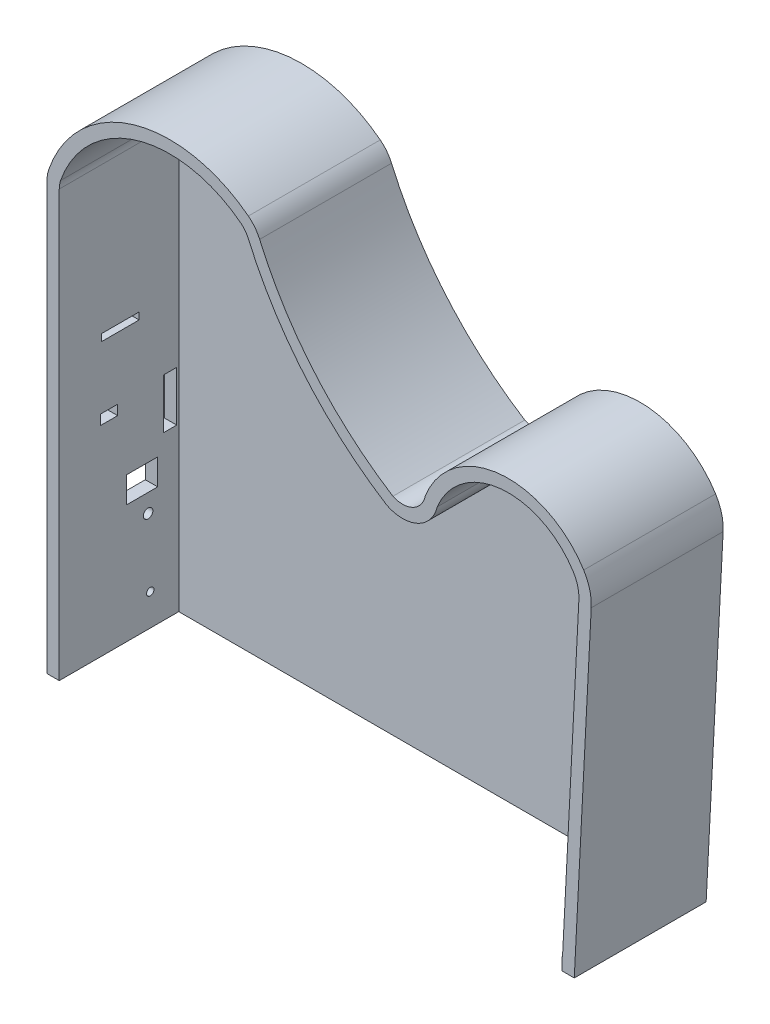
ISO-10303-21;
HEADER;
FILE_DESCRIPTION(('STEP AP214'),'2;1');
FILE_NAME('part.step','',(''),(''),'','','');
FILE_SCHEMA(('AUTOMOTIVE_DESIGN { 1 0 10303 214 1 1 1 1 }'));
ENDSEC;
DATA;
#1=APPLICATION_CONTEXT('core data for automotive mechanical design processes');
#2=APPLICATION_PROTOCOL_DEFINITION('international standard','automotive_design',2000,#1);
#3=PRODUCT_CONTEXT('',#1,'mechanical');
#4=PRODUCT('Part','Part','',(#3));
#5=PRODUCT_RELATED_PRODUCT_CATEGORY('part','',(#4));
#6=PRODUCT_DEFINITION_FORMATION('','',#4);
#7=PRODUCT_DEFINITION_CONTEXT('part definition',#1,'design');
#8=PRODUCT_DEFINITION('design','',#6,#7);
#9=PRODUCT_DEFINITION_SHAPE('','',#8);
#10=(LENGTH_UNIT() NAMED_UNIT(*) SI_UNIT(.MILLI.,.METRE.));
#11=(NAMED_UNIT(*) PLANE_ANGLE_UNIT() SI_UNIT($,.RADIAN.));
#12=(NAMED_UNIT(*) SI_UNIT($,.STERADIAN.) SOLID_ANGLE_UNIT());
#13=UNCERTAINTY_MEASURE_WITH_UNIT(LENGTH_MEASURE(1.E-05),#10,'distance_accuracy_value','');
#14=(GEOMETRIC_REPRESENTATION_CONTEXT(3) GLOBAL_UNCERTAINTY_ASSIGNED_CONTEXT((#13)) GLOBAL_UNIT_ASSIGNED_CONTEXT((#10,
#11,#12)) REPRESENTATION_CONTEXT('',''));
#15=CARTESIAN_POINT('',(0.,0.,0.));
#16=DIRECTION('',(0.,0.,1.));
#17=DIRECTION('',(1.,0.,0.));
#18=AXIS2_PLACEMENT_3D('',#15,#16,#17);
#19=CARTESIAN_POINT('',(0.,0.,-10.));
#20=DIRECTION('',(0.,0.,1.));
#21=DIRECTION('',(1.,0.,0.));
#22=AXIS2_PLACEMENT_3D('',#19,#20,#21);
#23=PLANE('',#22);
#24=CARTESIAN_POINT('',(468.596881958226,297.888088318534,-10.));
#25=DIRECTION('',(0.,0.,1.));
#26=DIRECTION('',(1.,0.,0.));
#27=AXIS2_PLACEMENT_3D('',#24,#25,#26);
#28=CIRCLE('',#27,71.9539704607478);
#29=CARTESIAN_POINT('',(401.59368414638,324.116800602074,-10.));
#30=VERTEX_POINT('',#29);
#31=CARTESIAN_POINT('',(529.512133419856,336.185686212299,-10.));
#32=VERTEX_POINT('',#31);
#33=EDGE_CURVE('E346',#30,#32,#28,.F.);
#34=ORIENTED_EDGE('',*,*,#33,.T.);
#35=CARTESIAN_POINT('',(495.648678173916,314.895632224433,-10.));
#36=DIRECTION('',(0.,0.,1.));
#37=DIRECTION('',(1.,0.,0.));
#38=AXIS2_PLACEMENT_3D('',#35,#36,#37);
#39=CIRCLE('',#38,40.);
#40=CARTESIAN_POINT('',(535.595522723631,312.834173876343,-10.));
#41=VERTEX_POINT('',#40);
#42=EDGE_CURVE('E11',#32,#41,#39,.F.);
#43=ORIENTED_EDGE('',*,*,#42,.T.);
#44=DIRECTION('',(-0.0515364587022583,-0.998671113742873,0.));
#45=VECTOR('',#44,1.);
#46=CARTESIAN_POINT('',(518.072036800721,-26.7351260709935,-10.));
#47=LINE('',#46,#45);
#48=CARTESIAN_POINT('',(521.881356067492,47.0816865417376,-10.));
#49=VERTEX_POINT('',#48);
#50=EDGE_CURVE('E320',#41,#49,#47,.T.);
#51=ORIENTED_EDGE('',*,*,#50,.T.);
#52=DIRECTION('',(-1.,0.,0.));
#53=VECTOR('',#52,1.);
#54=CARTESIAN_POINT('',(0.,47.0816865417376,-10.));
#55=LINE('',#54,#53);
#56=CARTESIAN_POINT('',(96.0120985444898,47.0816865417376,-10.));
#57=VERTEX_POINT('',#56);
#58=EDGE_CURVE('E307',#49,#57,#55,.T.);
#59=ORIENTED_EDGE('',*,*,#58,.T.);
#60=DIRECTION('',(0.,1.,0.));
#61=VECTOR('',#60,1.);
#62=CARTESIAN_POINT('',(96.0120985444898,0.,-10.));
#63=LINE('',#62,#61);
#64=CARTESIAN_POINT('',(96.0120985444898,390.867481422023,-10.));
#65=VERTEX_POINT('',#64);
#66=EDGE_CURVE('E306',#57,#65,#63,.T.);
#67=ORIENTED_EDGE('',*,*,#66,.T.);
#68=CARTESIAN_POINT('',(126.01209854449,390.867481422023,-10.));
#69=DIRECTION('',(0.,0.,1.));
#70=DIRECTION('',(1.,0.,0.));
#71=AXIS2_PLACEMENT_3D('',#68,#69,#70);
#72=CIRCLE('',#71,30.);
#73=CARTESIAN_POINT('',(97.6798278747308,400.730667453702,-10.));
#74=VERTEX_POINT('',#73);
#75=EDGE_CURVE('E341',#65,#74,#72,.F.);
#76=ORIENTED_EDGE('',*,*,#75,.T.);
#77=CARTESIAN_POINT('',(195.279411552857,366.753763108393,-10.));
#78=DIRECTION('',(0.,0.,1.));
#79=DIRECTION('',(1.,0.,0.));
#80=AXIS2_PLACEMENT_3D('',#77,#78,#79);
#81=CIRCLE('',#80,103.344611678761);
#82=CARTESIAN_POINT('',(258.713492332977,448.339461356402,-10.));
#83=VERTEX_POINT('',#82);
#84=EDGE_CURVE('E311',#74,#83,#81,.F.);
#85=ORIENTED_EDGE('',*,*,#84,.T.);
#86=CARTESIAN_POINT('',(240.299156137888,424.655875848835,-10.));
#87=DIRECTION('',(0.,0.,1.));
#88=DIRECTION('',(1.,0.,0.));
#89=AXIS2_PLACEMENT_3D('',#86,#87,#88);
#90=CIRCLE('',#89,30.);
#91=CARTESIAN_POINT('',(267.825723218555,436.584333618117,-10.));
#92=VERTEX_POINT('',#91);
#93=EDGE_CURVE('E324',#83,#92,#90,.F.);
#94=ORIENTED_EDGE('',*,*,#93,.T.);
#95=CARTESIAN_POINT('',(526.01209854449,548.467710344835,-10.));
#96=DIRECTION('',(0.,0.,1.));
#97=DIRECTION('',(1.,0.,0.));
#98=AXIS2_PLACEMENT_3D('',#95,#96,#97);
#99=CIRCLE('',#98,281.386023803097);
#100=CARTESIAN_POINT('',(375.446572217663,310.753350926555,-10.));
#101=VERTEX_POINT('',#100);
#102=EDGE_CURVE('E329',#101,#92,#99,.F.);
#103=ORIENTED_EDGE('',*,*,#102,.F.);
#104=CARTESIAN_POINT('',(383.206392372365,327.832005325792,-10.));
#105=DIRECTION('',(0.,0.,1.));
#106=DIRECTION('',(1.,0.,0.));
#107=AXIS2_PLACEMENT_3D('',#104,#105,#106);
#108=CIRCLE('',#107,18.7588710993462);
#109=EDGE_CURVE('E319',#101,#30,#108,.T.);
#110=ORIENTED_EDGE('',*,*,#109,.T.);
#111=EDGE_LOOP('',(#34,#43,#51,#59,#67,#76,#85,#94,#103,#110));
#112=FACE_BOUND('',#111,.T.);
#113=ADVANCED_FACE('F32',(#112),#23,.F.);
#114=CARTESIAN_POINT('',(195.279411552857,366.753763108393,0.));
#115=DIRECTION('',(0.,0.,1.));
#116=DIRECTION('',(1.,0.,0.));
#117=AXIS2_PLACEMENT_3D('',#114,#115,#116);
#118=CYLINDRICAL_SURFACE('',#117,103.344611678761);
#119=DIRECTION('',(0.,0.,1.));
#120=VECTOR('',#119,1.);
#121=CARTESIAN_POINT('',(97.6798278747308,400.730667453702,0.));
#122=LINE('',#121,#120);
#123=CARTESIAN_POINT('',(97.6798278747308,400.730667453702,96.5044158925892));
#124=VERTEX_POINT('',#123);
#125=EDGE_CURVE('E309',#74,#124,#122,.T.);
#126=ORIENTED_EDGE('',*,*,#125,.T.);
#127=CARTESIAN_POINT('',(195.279411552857,366.753763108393,96.5044158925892));
#128=DIRECTION('',(0.,0.,-1.));
#129=DIRECTION('',(-1.,0.,0.));
#130=AXIS2_PLACEMENT_3D('',#127,#128,#129);
#131=CIRCLE('',#130,103.344611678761);
#132=CARTESIAN_POINT('',(258.713492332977,448.339461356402,96.5044158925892));
#133=VERTEX_POINT('',#132);
#134=EDGE_CURVE('E366',#124,#133,#131,.T.);
#135=ORIENTED_EDGE('',*,*,#134,.T.);
#136=DIRECTION('',(0.,0.,1.));
#137=VECTOR('',#136,1.);
#138=CARTESIAN_POINT('',(258.713492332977,448.339461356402,0.));
#139=LINE('',#138,#137);
#140=EDGE_CURVE('E343',#133,#83,#139,.F.);
#141=ORIENTED_EDGE('',*,*,#140,.T.);
#142=ORIENTED_EDGE('',*,*,#84,.F.);
#143=EDGE_LOOP('',(#126,#135,#141,#142));
#144=FACE_BOUND('',#143,.T.);
#145=ADVANCED_FACE('F647',(#144),#118,.T.);
#146=CARTESIAN_POINT('',(96.0120985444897,525.036251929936,0.));
#147=DIRECTION('',(1.,0.,0.));
#148=DIRECTION('',(0.,1.,0.));
#149=AXIS2_PLACEMENT_3D('',#146,#147,#148);
#150=PLANE('',#149);
#151=CARTESIAN_POINT('',(96.0120985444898,72.6416865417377,23.));
#152=DIRECTION('',(-1.,0.,0.));
#153=DIRECTION('',(0.,-1.,0.));
#154=AXIS2_PLACEMENT_3D('',#151,#152,#153);
#155=CIRCLE('',#154,3.);
#156=CARTESIAN_POINT('',(96.0120985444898,69.6416865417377,23.));
#157=VERTEX_POINT('',#156);
#158=EDGE_CURVE('E374',#157,#157,#155,.T.);
#159=ORIENTED_EDGE('',*,*,#158,.F.);
#160=EDGE_LOOP('',(#159));
#161=FACE_BOUND('',#160,.T.);
#162=DIRECTION('',(0.,0.,-1.));
#163=VECTOR('',#162,1.);
#164=CARTESIAN_POINT('',(96.0120985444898,272.681686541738,62.42));
#165=LINE('',#164,#163);
#166=CARTESIAN_POINT('',(96.0120985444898,272.681686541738,62.42));
#167=VERTEX_POINT('',#166);
#168=CARTESIAN_POINT('',(96.0120985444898,272.681686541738,32.));
#169=VERTEX_POINT('',#168);
#170=EDGE_CURVE('E393',#167,#169,#165,.T.);
#171=ORIENTED_EDGE('',*,*,#170,.F.);
#172=DIRECTION('',(0.,1.,0.));
#173=VECTOR('',#172,1.);
#174=CARTESIAN_POINT('',(96.0120985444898,272.681686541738,62.42));
#175=LINE('',#174,#173);
#176=CARTESIAN_POINT('',(96.0120985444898,267.081686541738,62.42));
#177=VERTEX_POINT('',#176);
#178=EDGE_CURVE('E49',#177,#167,#175,.T.);
#179=ORIENTED_EDGE('',*,*,#178,.F.);
#180=DIRECTION('',(0.,0.,1.));
#181=VECTOR('',#180,1.);
#182=CARTESIAN_POINT('',(96.0120985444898,267.081686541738,62.42));
#183=LINE('',#182,#181);
#184=CARTESIAN_POINT('',(96.0120985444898,267.081686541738,32.));
#185=VERTEX_POINT('',#184);
#186=EDGE_CURVE('E384',#185,#177,#183,.T.);
#187=ORIENTED_EDGE('',*,*,#186,.F.);
#188=DIRECTION('',(0.,-1.,0.));
#189=VECTOR('',#188,1.);
#190=CARTESIAN_POINT('',(96.0120985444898,272.681686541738,32.));
#191=LINE('',#190,#189);
#192=EDGE_CURVE('E396',#169,#185,#191,.T.);
#193=ORIENTED_EDGE('',*,*,#192,.F.);
#194=EDGE_LOOP('',(#171,#179,#187,#193));
#195=FACE_BOUND('',#194,.T.);
#196=DIRECTION('',(0.,0.,-1.));
#197=VECTOR('',#196,1.);
#198=CARTESIAN_POINT('',(96.0120985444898,218.781686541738,12.45));
#199=LINE('',#198,#197);
#200=CARTESIAN_POINT('',(96.0120985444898,218.781686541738,12.45));
#201=VERTEX_POINT('',#200);
#202=CARTESIAN_POINT('',(96.0120985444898,218.781686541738,1.64999999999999));
#203=VERTEX_POINT('',#202);
#204=EDGE_CURVE('E424',#201,#203,#199,.T.);
#205=ORIENTED_EDGE('',*,*,#204,.F.);
#206=DIRECTION('',(0.,1.,0.));
#207=VECTOR('',#206,1.);
#208=CARTESIAN_POINT('',(96.0120985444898,218.781686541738,12.45));
#209=LINE('',#208,#207);
#210=CARTESIAN_POINT('',(96.0120985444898,178.381686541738,12.45));
#211=VERTEX_POINT('',#210);
#212=EDGE_CURVE('E403',#211,#201,#209,.T.);
#213=ORIENTED_EDGE('',*,*,#212,.F.);
#214=DIRECTION('',(0.,0.,1.));
#215=VECTOR('',#214,1.);
#216=CARTESIAN_POINT('',(96.0120985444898,178.381686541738,12.45));
#217=LINE('',#216,#215);
#218=CARTESIAN_POINT('',(96.0120985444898,178.381686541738,1.65));
#219=VERTEX_POINT('',#218);
#220=EDGE_CURVE('E413',#219,#211,#217,.T.);
#221=ORIENTED_EDGE('',*,*,#220,.F.);
#222=DIRECTION('',(0.,-1.,0.));
#223=VECTOR('',#222,1.);
#224=CARTESIAN_POINT('',(96.0120985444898,218.781686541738,1.64999999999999));
#225=LINE('',#224,#223);
#226=EDGE_CURVE('E427',#203,#219,#225,.T.);
#227=ORIENTED_EDGE('',*,*,#226,.F.);
#228=EDGE_LOOP('',(#205,#213,#221,#227));
#229=FACE_BOUND('',#228,.T.);
#230=DIRECTION('',(0.,0.,-1.));
#231=VECTOR('',#230,1.);
#232=CARTESIAN_POINT('',(96.0120985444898,216.831686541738,63.33));
#233=LINE('',#232,#231);
#234=CARTESIAN_POINT('',(96.0120985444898,216.831686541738,63.33));
#235=VERTEX_POINT('',#234);
#236=CARTESIAN_POINT('',(96.0120985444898,216.831686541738,49.33));
#237=VERTEX_POINT('',#236);
#238=EDGE_CURVE('E456',#235,#237,#233,.T.);
#239=ORIENTED_EDGE('',*,*,#238,.F.);
#240=DIRECTION('',(0.,1.,0.));
#241=VECTOR('',#240,1.);
#242=CARTESIAN_POINT('',(96.0120985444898,216.831686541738,63.33));
#243=LINE('',#242,#241);
#244=CARTESIAN_POINT('',(96.0120985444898,208.831686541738,63.33));
#245=VERTEX_POINT('',#244);
#246=EDGE_CURVE('E434',#245,#235,#243,.T.);
#247=ORIENTED_EDGE('',*,*,#246,.F.);
#248=DIRECTION('',(0.,0.,1.));
#249=VECTOR('',#248,1.);
#250=CARTESIAN_POINT('',(96.0120985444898,208.831686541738,63.33));
#251=LINE('',#250,#249);
#252=CARTESIAN_POINT('',(96.0120985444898,208.831686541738,49.33));
#253=VERTEX_POINT('',#252);
#254=EDGE_CURVE('E445',#253,#245,#251,.T.);
#255=ORIENTED_EDGE('',*,*,#254,.F.);
#256=DIRECTION('',(0.,-1.,0.));
#257=VECTOR('',#256,1.);
#258=CARTESIAN_POINT('',(96.0120985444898,216.831686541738,49.33));
#259=LINE('',#258,#257);
#260=EDGE_CURVE('E459',#237,#253,#259,.T.);
#261=ORIENTED_EDGE('',*,*,#260,.F.);
#262=EDGE_LOOP('',(#239,#247,#255,#261));
#263=FACE_BOUND('',#262,.T.);
#264=DIRECTION('',(0.,0.,-1.));
#265=VECTOR('',#264,1.);
#266=CARTESIAN_POINT('',(96.0120985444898,163.851686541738,42.));
#267=LINE('',#266,#265);
#268=CARTESIAN_POINT('',(96.0120985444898,163.851686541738,42.));
#269=VERTEX_POINT('',#268);
#270=CARTESIAN_POINT('',(96.0120985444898,163.851686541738,17.));
#271=VERTEX_POINT('',#270);
#272=EDGE_CURVE('E488',#269,#271,#267,.T.);
#273=ORIENTED_EDGE('',*,*,#272,.F.);
#274=DIRECTION('',(0.,1.,0.));
#275=VECTOR('',#274,1.);
#276=CARTESIAN_POINT('',(96.0120985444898,163.851686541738,42.));
#277=LINE('',#276,#275);
#278=CARTESIAN_POINT('',(96.0120985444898,142.851686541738,42.));
#279=VERTEX_POINT('',#278);
#280=EDGE_CURVE('E466',#279,#269,#277,.T.);
#281=ORIENTED_EDGE('',*,*,#280,.F.);
#282=DIRECTION('',(0.,0.,1.));
#283=VECTOR('',#282,1.);
#284=CARTESIAN_POINT('',(96.0120985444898,142.851686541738,42.));
#285=LINE('',#284,#283);
#286=CARTESIAN_POINT('',(96.0120985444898,142.851686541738,17.));
#287=VERTEX_POINT('',#286);
#288=EDGE_CURVE('E477',#287,#279,#285,.T.);
#289=ORIENTED_EDGE('',*,*,#288,.F.);
#290=DIRECTION('',(0.,-1.,0.));
#291=VECTOR('',#290,1.);
#292=CARTESIAN_POINT('',(96.0120985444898,163.851686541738,17.));
#293=LINE('',#292,#291);
#294=EDGE_CURVE('E491',#271,#287,#293,.T.);
#295=ORIENTED_EDGE('',*,*,#294,.F.);
#296=EDGE_LOOP('',(#273,#281,#289,#295));
#297=FACE_BOUND('',#296,.T.);
#298=CARTESIAN_POINT('',(96.0120985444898,128.171686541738,24.75));
#299=DIRECTION('',(-1.,0.,0.));
#300=DIRECTION('',(0.,-1.,0.));
#301=AXIS2_PLACEMENT_3D('',#298,#299,#300);
#302=CIRCLE('',#301,3.84999999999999);
#303=CARTESIAN_POINT('',(96.0120985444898,124.321686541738,24.75));
#304=VERTEX_POINT('',#303);
#305=EDGE_CURVE('E498',#304,#304,#302,.T.);
#306=ORIENTED_EDGE('',*,*,#305,.F.);
#307=EDGE_LOOP('',(#306));
#308=FACE_BOUND('',#307,.T.);
#309=DIRECTION('',(0.,0.,1.));
#310=VECTOR('',#309,1.);
#311=CARTESIAN_POINT('',(96.0120985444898,47.0816865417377,0.));
#312=LINE('',#311,#310);
#313=CARTESIAN_POINT('',(96.0120985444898,47.0816865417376,96.5044158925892));
#314=VERTEX_POINT('',#313);
#315=EDGE_CURVE('E296',#57,#314,#312,.T.);
#316=ORIENTED_EDGE('',*,*,#315,.T.);
#317=DIRECTION('',(0.,-1.,0.));
#318=VECTOR('',#317,1.);
#319=CARTESIAN_POINT('',(96.0120985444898,183.981686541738,96.5044158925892));
#320=LINE('',#319,#318);
#321=CARTESIAN_POINT('',(96.0120985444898,390.867481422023,96.5044158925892));
#322=VERTEX_POINT('',#321);
#323=EDGE_CURVE('E278',#322,#314,#320,.T.);
#324=ORIENTED_EDGE('',*,*,#323,.F.);
#325=DIRECTION('',(0.,0.,1.));
#326=VECTOR('',#325,1.);
#327=CARTESIAN_POINT('',(96.0120985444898,390.867481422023,0.));
#328=LINE('',#327,#326);
#329=EDGE_CURVE('E315',#322,#65,#328,.F.);
#330=ORIENTED_EDGE('',*,*,#329,.T.);
#331=ORIENTED_EDGE('',*,*,#66,.F.);
#332=EDGE_LOOP('',(#316,#324,#330,#331));
#333=FACE_BOUND('',#332,.T.);
#334=ADVANCED_FACE('F304',(#161,#195,#229,#263,#297,#308,#333),#150,.F.);
#335=CARTESIAN_POINT('',(69.0590141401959,47.0816865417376,0.));
#336=DIRECTION('',(0.,1.,0.));
#337=DIRECTION('',(0.,0.,1.));
#338=AXIS2_PLACEMENT_3D('',#335,#336,#337);
#339=PLANE('',#338);
#340=DIRECTION('',(0.,0.,1.));
#341=VECTOR('',#340,1.);
#342=CARTESIAN_POINT('',(521.881356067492,47.0816865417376,0.));
#343=LINE('',#342,#341);
#344=CARTESIAN_POINT('',(521.881356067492,47.0816865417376,96.5044158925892));
#345=VERTEX_POINT('',#344);
#346=EDGE_CURVE('E317',#49,#345,#343,.T.);
#347=ORIENTED_EDGE('',*,*,#346,.T.);
#348=DIRECTION('',(-1.,0.,0.));
#349=VECTOR('',#348,1.);
#350=CARTESIAN_POINT('',(69.0590141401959,47.0816865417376,96.5044158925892));
#351=LINE('',#350,#349);
#352=CARTESIAN_POINT('',(511.881356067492,47.0816865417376,96.5044158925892));
#353=VERTEX_POINT('',#352);
#354=EDGE_CURVE('E303',#345,#353,#351,.T.);
#355=ORIENTED_EDGE('',*,*,#354,.T.);
#356=DIRECTION('',(0.,0.,1.));
#357=VECTOR('',#356,1.);
#358=CARTESIAN_POINT('',(511.881356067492,47.0816865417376,262.314415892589));
#359=LINE('',#358,#357);
#360=CARTESIAN_POINT('',(511.881356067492,47.0816865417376,0.));
#361=VERTEX_POINT('',#360);
#362=EDGE_CURVE('E518',#361,#353,#359,.T.);
#363=ORIENTED_EDGE('',*,*,#362,.F.);
#364=DIRECTION('',(1.,0.,0.));
#365=VECTOR('',#364,1.);
#366=CARTESIAN_POINT('',(106.01209854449,47.0816865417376,0.));
#367=LINE('',#366,#365);
#368=CARTESIAN_POINT('',(106.01209854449,47.0816865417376,0.));
#369=VERTEX_POINT('',#368);
#370=EDGE_CURVE('E520',#369,#361,#367,.T.);
#371=ORIENTED_EDGE('',*,*,#370,.F.);
#372=DIRECTION('',(0.,0.,-1.));
#373=VECTOR('',#372,1.);
#374=CARTESIAN_POINT('',(106.01209854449,47.0816865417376,262.314415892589));
#375=LINE('',#374,#373);
#376=CARTESIAN_POINT('',(106.01209854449,47.0816865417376,96.5044158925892));
#377=VERTEX_POINT('',#376);
#378=EDGE_CURVE('E299',#377,#369,#375,.T.);
#379=ORIENTED_EDGE('',*,*,#378,.F.);
#380=EDGE_CURVE('E281',#377,#314,#351,.T.);
#381=ORIENTED_EDGE('',*,*,#380,.T.);
#382=ORIENTED_EDGE('',*,*,#315,.F.);
#383=ORIENTED_EDGE('',*,*,#58,.F.);
#384=EDGE_LOOP('',(#347,#355,#363,#371,#379,#381,#382,#383));
#385=FACE_BOUND('',#384,.T.);
#386=ADVANCED_FACE('F294',(#385),#339,.F.);
#387=CARTESIAN_POINT('',(126.01209854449,390.867481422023,0.));
#388=DIRECTION('',(0.,0.,1.));
#389=DIRECTION('',(1.,0.,0.));
#390=AXIS2_PLACEMENT_3D('',#387,#388,#389);
#391=CYLINDRICAL_SURFACE('',#390,30.);
#392=CARTESIAN_POINT('',(126.01209854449,390.867481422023,96.5044158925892));
#393=DIRECTION('',(0.,0.,-1.));
#394=DIRECTION('',(-1.,0.,0.));
#395=AXIS2_PLACEMENT_3D('',#392,#393,#394);
#396=CIRCLE('',#395,30.);
#397=EDGE_CURVE('E284',#124,#322,#396,.F.);
#398=ORIENTED_EDGE('',*,*,#397,.F.);
#399=ORIENTED_EDGE('',*,*,#125,.F.);
#400=ORIENTED_EDGE('',*,*,#75,.F.);
#401=ORIENTED_EDGE('',*,*,#329,.F.);
#402=EDGE_LOOP('',(#398,#399,#400,#401));
#403=FACE_BOUND('',#402,.T.);
#404=ADVANCED_FACE('F663',(#403),#391,.T.);
#405=CARTESIAN_POINT('',(383.206392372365,327.832005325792,0.));
#406=DIRECTION('',(0.,0.,1.));
#407=DIRECTION('',(1.,0.,0.));
#408=AXIS2_PLACEMENT_3D('',#405,#406,#407);
#409=CYLINDRICAL_SURFACE('',#408,18.7588710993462);
#410=DIRECTION('',(0.,0.,1.));
#411=VECTOR('',#410,1.);
#412=CARTESIAN_POINT('',(375.446572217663,310.753350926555,-10.));
#413=LINE('',#412,#411);
#414=CARTESIAN_POINT('',(375.446572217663,310.753350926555,96.5044158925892));
#415=VERTEX_POINT('',#414);
#416=EDGE_CURVE('E328',#101,#415,#413,.T.);
#417=ORIENTED_EDGE('',*,*,#416,.T.);
#418=CARTESIAN_POINT('',(383.206392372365,327.832005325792,96.5044158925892));
#419=DIRECTION('',(0.,0.,-1.));
#420=DIRECTION('',(-1.,0.,0.));
#421=AXIS2_PLACEMENT_3D('',#418,#419,#420);
#422=CIRCLE('',#421,18.7588710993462);
#423=CARTESIAN_POINT('',(401.59368414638,324.116800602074,96.5044158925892));
#424=VERTEX_POINT('',#423);
#425=EDGE_CURVE('E369',#415,#424,#422,.F.);
#426=ORIENTED_EDGE('',*,*,#425,.T.);
#427=DIRECTION('',(0.,0.,1.));
#428=VECTOR('',#427,1.);
#429=CARTESIAN_POINT('',(401.59368414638,324.116800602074,-10.));
#430=LINE('',#429,#428);
#431=EDGE_CURVE('E326',#30,#424,#430,.T.);
#432=ORIENTED_EDGE('',*,*,#431,.F.);
#433=ORIENTED_EDGE('',*,*,#109,.F.);
#434=EDGE_LOOP('',(#417,#426,#432,#433));
#435=FACE_BOUND('',#434,.T.);
#436=ADVANCED_FACE('F630',(#435),#409,.F.);
#437=CARTESIAN_POINT('',(526.01209854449,548.467710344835,0.));
#438=DIRECTION('',(0.,0.,1.));
#439=DIRECTION('',(1.,0.,0.));
#440=AXIS2_PLACEMENT_3D('',#437,#438,#439);
#441=CYLINDRICAL_SURFACE('',#440,281.386023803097);
#442=CARTESIAN_POINT('',(526.01209854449,548.467710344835,96.5044158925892));
#443=DIRECTION('',(0.,0.,-1.));
#444=DIRECTION('',(-1.,0.,0.));
#445=AXIS2_PLACEMENT_3D('',#442,#443,#444);
#446=CIRCLE('',#445,281.386023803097);
#447=CARTESIAN_POINT('',(267.825723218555,436.584333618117,96.5044158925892));
#448=VERTEX_POINT('',#447);
#449=EDGE_CURVE('E359',#415,#448,#446,.T.);
#450=ORIENTED_EDGE('',*,*,#449,.F.);
#451=ORIENTED_EDGE('',*,*,#416,.F.);
#452=ORIENTED_EDGE('',*,*,#102,.T.);
#453=DIRECTION('',(0.,0.,1.));
#454=VECTOR('',#453,1.);
#455=CARTESIAN_POINT('',(267.825723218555,436.584333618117,0.));
#456=LINE('',#455,#454);
#457=EDGE_CURVE('E36',#92,#448,#456,.T.);
#458=ORIENTED_EDGE('',*,*,#457,.T.);
#459=EDGE_LOOP('',(#450,#451,#452,#458));
#460=FACE_BOUND('',#459,.T.);
#461=ADVANCED_FACE('F358',(#460),#441,.F.);
#462=CARTESIAN_POINT('',(468.596881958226,297.888088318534,0.));
#463=DIRECTION('',(0.,0.,1.));
#464=DIRECTION('',(1.,0.,0.));
#465=AXIS2_PLACEMENT_3D('',#462,#463,#464);
#466=CYLINDRICAL_SURFACE('',#465,71.9539704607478);
#467=ORIENTED_EDGE('',*,*,#431,.T.);
#468=CARTESIAN_POINT('',(468.596881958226,297.888088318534,96.5044158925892));
#469=DIRECTION('',(0.,0.,-1.));
#470=DIRECTION('',(-1.,0.,0.));
#471=AXIS2_PLACEMENT_3D('',#468,#469,#470);
#472=CIRCLE('',#471,71.9539704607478);
#473=CARTESIAN_POINT('',(529.512133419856,336.185686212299,96.5044158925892));
#474=VERTEX_POINT('',#473);
#475=EDGE_CURVE('E628',#424,#474,#472,.T.);
#476=ORIENTED_EDGE('',*,*,#475,.T.);
#477=DIRECTION('',(0.,0.,1.));
#478=VECTOR('',#477,1.);
#479=CARTESIAN_POINT('',(529.512133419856,336.185686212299,0.));
#480=LINE('',#479,#478);
#481=EDGE_CURVE('E41',#474,#32,#480,.F.);
#482=ORIENTED_EDGE('',*,*,#481,.T.);
#483=ORIENTED_EDGE('',*,*,#33,.F.);
#484=EDGE_LOOP('',(#467,#476,#482,#483));
#485=FACE_BOUND('',#484,.T.);
#486=ADVANCED_FACE('F633',(#485),#466,.T.);
#487=CARTESIAN_POINT('',(240.299156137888,424.655875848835,0.));
#488=DIRECTION('',(0.,0.,-1.));
#489=DIRECTION('',(-1.,0.,0.));
#490=AXIS2_PLACEMENT_3D('',#487,#488,#489);
#491=CYLINDRICAL_SURFACE('',#490,30.);
#492=CARTESIAN_POINT('',(240.299156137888,424.655875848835,96.5044158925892));
#493=DIRECTION('',(0.,0.,-1.));
#494=DIRECTION('',(-1.,0.,0.));
#495=AXIS2_PLACEMENT_3D('',#492,#493,#494);
#496=CIRCLE('',#495,30.);
#497=EDGE_CURVE('E365',#448,#133,#496,.F.);
#498=ORIENTED_EDGE('',*,*,#497,.F.);
#499=ORIENTED_EDGE('',*,*,#457,.F.);
#500=ORIENTED_EDGE('',*,*,#93,.F.);
#501=ORIENTED_EDGE('',*,*,#140,.F.);
#502=EDGE_LOOP('',(#498,#499,#500,#501));
#503=FACE_BOUND('',#502,.T.);
#504=ADVANCED_FACE('F363',(#503),#491,.T.);
#505=CARTESIAN_POINT('',(535.998809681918,320.649049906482,0.));
#506=DIRECTION('',(-0.998671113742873,0.0515364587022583,0.));
#507=DIRECTION('',(-0.0515364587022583,-0.998671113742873,0.));
#508=AXIS2_PLACEMENT_3D('',#505,#506,#507);
#509=PLANE('',#508);
#510=DIRECTION('',(0.0515364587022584,0.998671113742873,0.));
#511=VECTOR('',#510,1.);
#512=CARTESIAN_POINT('',(522.413629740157,57.3960611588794,96.5044158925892));
#513=LINE('',#512,#511);
#514=CARTESIAN_POINT('',(535.595522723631,312.834173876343,96.5044158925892));
#515=VERTEX_POINT('',#514);
#516=EDGE_CURVE('E509',#345,#515,#513,.T.);
#517=ORIENTED_EDGE('',*,*,#516,.F.);
#518=ORIENTED_EDGE('',*,*,#346,.F.);
#519=ORIENTED_EDGE('',*,*,#50,.F.);
#520=DIRECTION('',(0.,0.,1.));
#521=VECTOR('',#520,1.);
#522=CARTESIAN_POINT('',(535.595522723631,312.834173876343,0.));
#523=LINE('',#522,#521);
#524=EDGE_CURVE('E321',#41,#515,#523,.T.);
#525=ORIENTED_EDGE('',*,*,#524,.T.);
#526=EDGE_LOOP('',(#517,#518,#519,#525));
#527=FACE_BOUND('',#526,.T.);
#528=ADVANCED_FACE('F583',(#527),#509,.F.);
#529=CARTESIAN_POINT('',(495.648678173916,314.895632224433,0.));
#530=DIRECTION('',(0.,0.,1.));
#531=DIRECTION('',(1.,0.,0.));
#532=AXIS2_PLACEMENT_3D('',#529,#530,#531);
#533=CYLINDRICAL_SURFACE('',#532,40.);
#534=CARTESIAN_POINT('',(495.648678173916,314.895632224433,96.5044158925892));
#535=DIRECTION('',(0.,0.,-1.));
#536=DIRECTION('',(-1.,0.,0.));
#537=AXIS2_PLACEMENT_3D('',#534,#535,#536);
#538=CIRCLE('',#537,40.);
#539=EDGE_CURVE('E626',#515,#474,#538,.F.);
#540=ORIENTED_EDGE('',*,*,#539,.F.);
#541=ORIENTED_EDGE('',*,*,#524,.F.);
#542=ORIENTED_EDGE('',*,*,#42,.F.);
#543=ORIENTED_EDGE('',*,*,#481,.F.);
#544=EDGE_LOOP('',(#540,#541,#542,#543));
#545=FACE_BOUND('',#544,.T.);
#546=ADVANCED_FACE('F34',(#545),#533,.T.);
#547=CARTESIAN_POINT('',(0.,0.,0.));
#548=DIRECTION('',(0.,0.,1.));
#549=DIRECTION('',(1.,0.,0.));
#550=AXIS2_PLACEMENT_3D('',#547,#548,#549);
#551=PLANE('',#550);
#552=CARTESIAN_POINT('',(468.596881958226,297.888088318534,0.));
#553=DIRECTION('',(0.,0.,1.));
#554=DIRECTION('',(1.,0.,0.));
#555=AXIS2_PLACEMENT_3D('',#552,#553,#554);
#556=CIRCLE('',#555,61.9539704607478);
#557=CARTESIAN_POINT('',(411.181665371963,321.164414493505,0.));
#558=VERTEX_POINT('',#557);
#559=CARTESIAN_POINT('',(521.046269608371,330.863172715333,0.));
#560=VERTEX_POINT('',#559);
#561=EDGE_CURVE('E534',#558,#560,#556,.F.);
#562=ORIENTED_EDGE('',*,*,#561,.F.);
#563=CARTESIAN_POINT('',(383.206392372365,327.832005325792,0.));
#564=DIRECTION('',(0.,0.,1.));
#565=DIRECTION('',(1.,0.,0.));
#566=AXIS2_PLACEMENT_3D('',#563,#564,#565);
#567=CIRCLE('',#566,28.7588710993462);
#568=CARTESIAN_POINT('',(370.623095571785,301.972126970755,0.));
#569=VERTEX_POINT('',#568);
#570=EDGE_CURVE('E531',#569,#558,#567,.T.);
#571=ORIENTED_EDGE('',*,*,#570,.F.);
#572=CARTESIAN_POINT('',(526.01209854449,548.467710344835,0.));
#573=DIRECTION('',(0.,0.,1.));
#574=DIRECTION('',(1.,0.,0.));
#575=AXIS2_PLACEMENT_3D('',#572,#573,#574);
#576=CIRCLE('',#575,291.386023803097);
#577=CARTESIAN_POINT('',(258.650200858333,432.608181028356,0.));
#578=VERTEX_POINT('',#577);
#579=EDGE_CURVE('E537',#569,#578,#576,.F.);
#580=ORIENTED_EDGE('',*,*,#579,.T.);
#581=CARTESIAN_POINT('',(240.299156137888,424.655875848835,0.));
#582=DIRECTION('',(0.,0.,1.));
#583=DIRECTION('',(1.,0.,0.));
#584=AXIS2_PLACEMENT_3D('',#581,#582,#583);
#585=CIRCLE('',#584,20.);
#586=CARTESIAN_POINT('',(252.575380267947,440.44493285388,0.));
#587=VERTEX_POINT('',#586);
#588=EDGE_CURVE('E567',#587,#578,#585,.F.);
#589=ORIENTED_EDGE('',*,*,#588,.F.);
#590=CARTESIAN_POINT('',(195.279411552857,366.753763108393,0.));
#591=DIRECTION('',(0.,0.,1.));
#592=DIRECTION('',(1.,0.,0.));
#593=AXIS2_PLACEMENT_3D('',#590,#591,#592);
#594=CIRCLE('',#593,93.3446116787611);
#595=CARTESIAN_POINT('',(107.123918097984,397.442938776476,0.));
#596=VERTEX_POINT('',#595);
#597=EDGE_CURVE('E544',#596,#587,#594,.F.);
#598=ORIENTED_EDGE('',*,*,#597,.F.);
#599=CARTESIAN_POINT('',(126.01209854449,390.867481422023,0.));
#600=DIRECTION('',(0.,0.,1.));
#601=DIRECTION('',(1.,0.,0.));
#602=AXIS2_PLACEMENT_3D('',#599,#600,#601);
#603=CIRCLE('',#602,20.);
#604=CARTESIAN_POINT('',(106.01209854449,390.867481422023,0.));
#605=VERTEX_POINT('',#604);
#606=EDGE_CURVE('E560',#605,#596,#603,.F.);
#607=ORIENTED_EDGE('',*,*,#606,.F.);
#608=DIRECTION('',(0.,1.,0.));
#609=VECTOR('',#608,1.);
#610=CARTESIAN_POINT('',(106.01209854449,0.,0.));
#611=LINE('',#610,#609);
#612=EDGE_CURVE('E552',#369,#605,#611,.T.);
#613=ORIENTED_EDGE('',*,*,#612,.F.);
#614=ORIENTED_EDGE('',*,*,#370,.T.);
#615=DIRECTION('',(0.,-1.,0.));
#616=VECTOR('',#615,1.);
#617=CARTESIAN_POINT('',(511.881356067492,57.0816865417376,0.));
#618=LINE('',#617,#616);
#619=CARTESIAN_POINT('',(511.881356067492,57.0816865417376,0.));
#620=VERTEX_POINT('',#619);
#621=EDGE_CURVE('E517',#620,#361,#618,.T.);
#622=ORIENTED_EDGE('',*,*,#621,.F.);
#623=DIRECTION('',(-1.,0.,0.));
#624=VECTOR('',#623,1.);
#625=CARTESIAN_POINT('',(69.0590141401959,57.0816865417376,0.));
#626=LINE('',#625,#624);
#627=CARTESIAN_POINT('',(512.384099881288,57.0816865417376,0.));
#628=VERTEX_POINT('',#627);
#629=EDGE_CURVE('E549',#628,#620,#626,.T.);
#630=ORIENTED_EDGE('',*,*,#629,.F.);
#631=DIRECTION('',(-0.0515364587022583,-0.998671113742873,0.));
#632=VECTOR('',#631,1.);
#633=CARTESIAN_POINT('',(526.01209854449,321.164414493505,0.));
#634=LINE('',#633,#632);
#635=CARTESIAN_POINT('',(525.608811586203,313.349538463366,0.));
#636=VERTEX_POINT('',#635);
#637=EDGE_CURVE('E526',#636,#628,#634,.T.);
#638=ORIENTED_EDGE('',*,*,#637,.F.);
#639=CARTESIAN_POINT('',(495.648678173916,314.895632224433,0.));
#640=DIRECTION('',(0.,0.,1.));
#641=DIRECTION('',(1.,0.,0.));
#642=AXIS2_PLACEMENT_3D('',#639,#640,#641);
#643=CIRCLE('',#642,30.);
#644=EDGE_CURVE('E574',#560,#636,#643,.F.);
#645=ORIENTED_EDGE('',*,*,#644,.F.);
#646=EDGE_LOOP('',(#562,#571,#580,#589,#598,#607,#613,#614,#622,#630,#638,#645));
#647=FACE_BOUND('',#646,.T.);
#648=ADVANCED_FACE('F596',(#647),#551,.T.);
#649=CARTESIAN_POINT('',(195.279411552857,366.753763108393,0.));
#650=DIRECTION('',(0.,0.,1.));
#651=DIRECTION('',(1.,0.,0.));
#652=AXIS2_PLACEMENT_3D('',#649,#650,#651);
#653=CYLINDRICAL_SURFACE('',#652,93.3446116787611);
#654=CARTESIAN_POINT('',(195.279411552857,366.753763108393,96.5044158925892));
#655=DIRECTION('',(0.,0.,-1.));
#656=DIRECTION('',(-1.,0.,0.));
#657=AXIS2_PLACEMENT_3D('',#654,#655,#656);
#658=CIRCLE('',#657,93.3446116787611);
#659=CARTESIAN_POINT('',(107.123918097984,397.442938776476,96.5044158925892));
#660=VERTEX_POINT('',#659);
#661=CARTESIAN_POINT('',(252.575380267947,440.44493285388,96.5044158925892));
#662=VERTEX_POINT('',#661);
#663=EDGE_CURVE('E608',#660,#662,#658,.T.);
#664=ORIENTED_EDGE('',*,*,#663,.F.);
#665=DIRECTION('',(0.,0.,1.));
#666=VECTOR('',#665,1.);
#667=CARTESIAN_POINT('',(107.123918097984,397.442938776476,0.));
#668=LINE('',#667,#666);
#669=EDGE_CURVE('E555',#596,#660,#668,.T.);
#670=ORIENTED_EDGE('',*,*,#669,.F.);
#671=ORIENTED_EDGE('',*,*,#597,.T.);
#672=DIRECTION('',(0.,0.,1.));
#673=VECTOR('',#672,1.);
#674=CARTESIAN_POINT('',(252.575380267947,440.44493285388,0.));
#675=LINE('',#674,#673);
#676=EDGE_CURVE('E565',#662,#587,#675,.F.);
#677=ORIENTED_EDGE('',*,*,#676,.F.);
#678=EDGE_LOOP('',(#664,#670,#671,#677));
#679=FACE_BOUND('',#678,.T.);
#680=ADVANCED_FACE('F643',(#679),#653,.F.);
#681=CARTESIAN_POINT('',(106.01209854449,525.036251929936,0.));
#682=DIRECTION('',(1.,0.,0.));
#683=DIRECTION('',(0.,1.,0.));
#684=AXIS2_PLACEMENT_3D('',#681,#682,#683);
#685=PLANE('',#684);
#686=DIRECTION('',(0.,-1.,0.));
#687=VECTOR('',#686,1.);
#688=CARTESIAN_POINT('',(106.01209854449,183.981686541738,96.5044158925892));
#689=LINE('',#688,#687);
#690=CARTESIAN_POINT('',(106.01209854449,390.867481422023,96.5044158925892));
#691=VERTEX_POINT('',#690);
#692=EDGE_CURVE('E288',#691,#377,#689,.T.);
#693=ORIENTED_EDGE('',*,*,#692,.T.);
#694=ORIENTED_EDGE('',*,*,#378,.T.);
#695=ORIENTED_EDGE('',*,*,#612,.T.);
#696=DIRECTION('',(0.,0.,1.));
#697=VECTOR('',#696,1.);
#698=CARTESIAN_POINT('',(106.01209854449,390.867481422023,0.));
#699=LINE('',#698,#697);
#700=EDGE_CURVE('E558',#691,#605,#699,.F.);
#701=ORIENTED_EDGE('',*,*,#700,.F.);
#702=EDGE_LOOP('',(#693,#694,#695,#701));
#703=FACE_BOUND('',#702,.T.);
#704=CARTESIAN_POINT('',(106.01209854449,72.6416865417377,23.));
#705=DIRECTION('',(-1.,0.,0.));
#706=DIRECTION('',(0.,-1.,0.));
#707=AXIS2_PLACEMENT_3D('',#704,#705,#706);
#708=CIRCLE('',#707,3.);
#709=CARTESIAN_POINT('',(106.01209854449,69.6416865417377,23.));
#710=VERTEX_POINT('',#709);
#711=EDGE_CURVE('E375',#710,#710,#708,.T.);
#712=ORIENTED_EDGE('',*,*,#711,.T.);
#713=EDGE_LOOP('',(#712));
#714=FACE_BOUND('',#713,.T.);
#715=DIRECTION('',(0.,1.,0.));
#716=VECTOR('',#715,1.);
#717=CARTESIAN_POINT('',(106.01209854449,272.681686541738,62.42));
#718=LINE('',#717,#716);
#719=CARTESIAN_POINT('',(106.01209854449,267.081686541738,62.42));
#720=VERTEX_POINT('',#719);
#721=CARTESIAN_POINT('',(106.01209854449,272.681686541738,62.42));
#722=VERTEX_POINT('',#721);
#723=EDGE_CURVE('E380',#720,#722,#718,.T.);
#724=ORIENTED_EDGE('',*,*,#723,.T.);
#725=DIRECTION('',(0.,0.,-1.));
#726=VECTOR('',#725,1.);
#727=CARTESIAN_POINT('',(106.01209854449,272.681686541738,62.42));
#728=LINE('',#727,#726);
#729=CARTESIAN_POINT('',(106.01209854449,272.681686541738,32.));
#730=VERTEX_POINT('',#729);
#731=EDGE_CURVE('E383',#722,#730,#728,.T.);
#732=ORIENTED_EDGE('',*,*,#731,.T.);
#733=DIRECTION('',(0.,-1.,0.));
#734=VECTOR('',#733,1.);
#735=CARTESIAN_POINT('',(106.01209854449,272.681686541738,32.));
#736=LINE('',#735,#734);
#737=CARTESIAN_POINT('',(106.01209854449,267.081686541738,32.));
#738=VERTEX_POINT('',#737);
#739=EDGE_CURVE('E57',#730,#738,#736,.T.);
#740=ORIENTED_EDGE('',*,*,#739,.T.);
#741=DIRECTION('',(0.,0.,1.));
#742=VECTOR('',#741,1.);
#743=CARTESIAN_POINT('',(106.01209854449,267.081686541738,62.42));
#744=LINE('',#743,#742);
#745=EDGE_CURVE('E388',#738,#720,#744,.T.);
#746=ORIENTED_EDGE('',*,*,#745,.T.);
#747=EDGE_LOOP('',(#724,#732,#740,#746));
#748=FACE_BOUND('',#747,.T.);
#749=DIRECTION('',(0.,1.,0.));
#750=VECTOR('',#749,1.);
#751=CARTESIAN_POINT('',(106.01209854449,218.781686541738,12.45));
#752=LINE('',#751,#750);
#753=CARTESIAN_POINT('',(106.01209854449,178.381686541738,12.45));
#754=VERTEX_POINT('',#753);
#755=CARTESIAN_POINT('',(106.01209854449,218.781686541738,12.45));
#756=VERTEX_POINT('',#755);
#757=EDGE_CURVE('E409',#754,#756,#752,.T.);
#758=ORIENTED_EDGE('',*,*,#757,.T.);
#759=DIRECTION('',(0.,0.,-1.));
#760=VECTOR('',#759,1.);
#761=CARTESIAN_POINT('',(106.01209854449,218.781686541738,12.45));
#762=LINE('',#761,#760);
#763=CARTESIAN_POINT('',(106.01209854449,218.781686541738,1.64999999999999));
#764=VERTEX_POINT('',#763);
#765=EDGE_CURVE('E412',#756,#764,#762,.T.);
#766=ORIENTED_EDGE('',*,*,#765,.T.);
#767=DIRECTION('',(0.,-1.,0.));
#768=VECTOR('',#767,1.);
#769=CARTESIAN_POINT('',(106.01209854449,218.781686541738,1.64999999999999));
#770=LINE('',#769,#768);
#771=CARTESIAN_POINT('',(106.01209854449,178.381686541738,1.65));
#772=VERTEX_POINT('',#771);
#773=EDGE_CURVE('E416',#764,#772,#770,.T.);
#774=ORIENTED_EDGE('',*,*,#773,.T.);
#775=DIRECTION('',(0.,0.,1.));
#776=VECTOR('',#775,1.);
#777=CARTESIAN_POINT('',(106.01209854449,178.381686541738,12.45));
#778=LINE('',#777,#776);
#779=EDGE_CURVE('E419',#772,#754,#778,.T.);
#780=ORIENTED_EDGE('',*,*,#779,.T.);
#781=EDGE_LOOP('',(#758,#766,#774,#780));
#782=FACE_BOUND('',#781,.T.);
#783=DIRECTION('',(0.,1.,0.));
#784=VECTOR('',#783,1.);
#785=CARTESIAN_POINT('',(106.01209854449,216.831686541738,63.33));
#786=LINE('',#785,#784);
#787=CARTESIAN_POINT('',(106.01209854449,208.831686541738,63.33));
#788=VERTEX_POINT('',#787);
#789=CARTESIAN_POINT('',(106.01209854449,216.831686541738,63.33));
#790=VERTEX_POINT('',#789);
#791=EDGE_CURVE('E441',#788,#790,#786,.T.);
#792=ORIENTED_EDGE('',*,*,#791,.T.);
#793=DIRECTION('',(0.,0.,-1.));
#794=VECTOR('',#793,1.);
#795=CARTESIAN_POINT('',(106.01209854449,216.831686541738,63.33));
#796=LINE('',#795,#794);
#797=CARTESIAN_POINT('',(106.01209854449,216.831686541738,49.33));
#798=VERTEX_POINT('',#797);
#799=EDGE_CURVE('E444',#790,#798,#796,.T.);
#800=ORIENTED_EDGE('',*,*,#799,.T.);
#801=DIRECTION('',(0.,-1.,0.));
#802=VECTOR('',#801,1.);
#803=CARTESIAN_POINT('',(106.01209854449,216.831686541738,49.33));
#804=LINE('',#803,#802);
#805=CARTESIAN_POINT('',(106.01209854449,208.831686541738,49.33));
#806=VERTEX_POINT('',#805);
#807=EDGE_CURVE('E448',#798,#806,#804,.T.);
#808=ORIENTED_EDGE('',*,*,#807,.T.);
#809=DIRECTION('',(0.,0.,1.));
#810=VECTOR('',#809,1.);
#811=CARTESIAN_POINT('',(106.01209854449,208.831686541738,63.33));
#812=LINE('',#811,#810);
#813=EDGE_CURVE('E451',#806,#788,#812,.T.);
#814=ORIENTED_EDGE('',*,*,#813,.T.);
#815=EDGE_LOOP('',(#792,#800,#808,#814));
#816=FACE_BOUND('',#815,.T.);
#817=DIRECTION('',(0.,1.,0.));
#818=VECTOR('',#817,1.);
#819=CARTESIAN_POINT('',(106.01209854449,163.851686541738,42.));
#820=LINE('',#819,#818);
#821=CARTESIAN_POINT('',(106.01209854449,142.851686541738,42.));
#822=VERTEX_POINT('',#821);
#823=CARTESIAN_POINT('',(106.01209854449,163.851686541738,42.));
#824=VERTEX_POINT('',#823);
#825=EDGE_CURVE('E473',#822,#824,#820,.T.);
#826=ORIENTED_EDGE('',*,*,#825,.T.);
#827=DIRECTION('',(0.,0.,-1.));
#828=VECTOR('',#827,1.);
#829=CARTESIAN_POINT('',(106.01209854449,163.851686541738,42.));
#830=LINE('',#829,#828);
#831=CARTESIAN_POINT('',(106.01209854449,163.851686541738,17.));
#832=VERTEX_POINT('',#831);
#833=EDGE_CURVE('E476',#824,#832,#830,.T.);
#834=ORIENTED_EDGE('',*,*,#833,.T.);
#835=DIRECTION('',(0.,-1.,0.));
#836=VECTOR('',#835,1.);
#837=CARTESIAN_POINT('',(106.01209854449,163.851686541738,17.));
#838=LINE('',#837,#836);
#839=CARTESIAN_POINT('',(106.01209854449,142.851686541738,17.));
#840=VERTEX_POINT('',#839);
#841=EDGE_CURVE('E480',#832,#840,#838,.T.);
#842=ORIENTED_EDGE('',*,*,#841,.T.);
#843=DIRECTION('',(0.,0.,1.));
#844=VECTOR('',#843,1.);
#845=CARTESIAN_POINT('',(106.01209854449,142.851686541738,42.));
#846=LINE('',#845,#844);
#847=EDGE_CURVE('E483',#840,#822,#846,.T.);
#848=ORIENTED_EDGE('',*,*,#847,.T.);
#849=EDGE_LOOP('',(#826,#834,#842,#848));
#850=FACE_BOUND('',#849,.T.);
#851=CARTESIAN_POINT('',(106.01209854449,128.171686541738,24.75));
#852=DIRECTION('',(-1.,0.,0.));
#853=DIRECTION('',(0.,-1.,0.));
#854=AXIS2_PLACEMENT_3D('',#851,#852,#853);
#855=CIRCLE('',#854,3.84999999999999);
#856=CARTESIAN_POINT('',(106.01209854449,124.321686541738,24.75));
#857=VERTEX_POINT('',#856);
#858=EDGE_CURVE('E289',#857,#857,#855,.T.);
#859=ORIENTED_EDGE('',*,*,#858,.T.);
#860=EDGE_LOOP('',(#859));
#861=FACE_BOUND('',#860,.T.);
#862=ADVANCED_FACE('F601',(#703,#714,#748,#782,#816,#850,#861),#685,.T.);
#863=CARTESIAN_POINT('',(69.0590141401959,57.0816865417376,0.));
#864=DIRECTION('',(0.,1.,0.));
#865=DIRECTION('',(0.,0.,1.));
#866=AXIS2_PLACEMENT_3D('',#863,#864,#865);
#867=PLANE('',#866);
#868=DIRECTION('',(-1.,0.,0.));
#869=VECTOR('',#868,1.);
#870=CARTESIAN_POINT('',(69.0590141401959,57.0816865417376,96.5044158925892));
#871=LINE('',#870,#869);
#872=CARTESIAN_POINT('',(512.384099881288,57.0816865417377,96.5044158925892));
#873=VERTEX_POINT('',#872);
#874=CARTESIAN_POINT('',(511.881356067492,57.0816865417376,96.5044158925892));
#875=VERTEX_POINT('',#874);
#876=EDGE_CURVE('E587',#873,#875,#871,.T.);
#877=ORIENTED_EDGE('',*,*,#876,.F.);
#878=DIRECTION('',(0.,0.,1.));
#879=VECTOR('',#878,1.);
#880=CARTESIAN_POINT('',(512.384099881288,57.0816865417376,0.));
#881=LINE('',#880,#879);
#882=EDGE_CURVE('E528',#628,#873,#881,.T.);
#883=ORIENTED_EDGE('',*,*,#882,.F.);
#884=ORIENTED_EDGE('',*,*,#629,.T.);
#885=DIRECTION('',(0.,0.,1.));
#886=VECTOR('',#885,1.);
#887=CARTESIAN_POINT('',(511.881356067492,57.0816865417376,262.314415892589));
#888=LINE('',#887,#886);
#889=EDGE_CURVE('E514',#620,#875,#888,.T.);
#890=ORIENTED_EDGE('',*,*,#889,.T.);
#891=EDGE_LOOP('',(#877,#883,#884,#890));
#892=FACE_BOUND('',#891,.T.);
#893=ADVANCED_FACE('F938',(#892),#867,.T.);
#894=CARTESIAN_POINT('',(126.01209854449,390.867481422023,0.));
#895=DIRECTION('',(0.,0.,1.));
#896=DIRECTION('',(1.,0.,0.));
#897=AXIS2_PLACEMENT_3D('',#894,#895,#896);
#898=CYLINDRICAL_SURFACE('',#897,20.);
#899=ORIENTED_EDGE('',*,*,#669,.T.);
#900=CARTESIAN_POINT('',(126.01209854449,390.867481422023,96.5044158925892));
#901=DIRECTION('',(0.,0.,-1.));
#902=DIRECTION('',(-1.,0.,0.));
#903=AXIS2_PLACEMENT_3D('',#900,#901,#902);
#904=CIRCLE('',#903,20.);
#905=EDGE_CURVE('E300',#660,#691,#904,.F.);
#906=ORIENTED_EDGE('',*,*,#905,.T.);
#907=ORIENTED_EDGE('',*,*,#700,.T.);
#908=ORIENTED_EDGE('',*,*,#606,.T.);
#909=EDGE_LOOP('',(#899,#906,#907,#908));
#910=FACE_BOUND('',#909,.T.);
#911=ADVANCED_FACE('F606',(#910),#898,.F.);
#912=CARTESIAN_POINT('',(383.206392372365,327.832005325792,0.));
#913=DIRECTION('',(0.,0.,1.));
#914=DIRECTION('',(1.,0.,0.));
#915=AXIS2_PLACEMENT_3D('',#912,#913,#914);
#916=CYLINDRICAL_SURFACE('',#915,28.7588710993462);
#917=CARTESIAN_POINT('',(383.206392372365,327.832005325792,96.5044158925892));
#918=DIRECTION('',(0.,0.,-1.));
#919=DIRECTION('',(-1.,0.,0.));
#920=AXIS2_PLACEMENT_3D('',#917,#918,#919);
#921=CIRCLE('',#920,28.7588710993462);
#922=CARTESIAN_POINT('',(370.623095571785,301.972126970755,96.5044158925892));
#923=VERTEX_POINT('',#922);
#924=CARTESIAN_POINT('',(411.181665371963,321.164414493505,96.5044158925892));
#925=VERTEX_POINT('',#924);
#926=EDGE_CURVE('E619',#923,#925,#921,.F.);
#927=ORIENTED_EDGE('',*,*,#926,.F.);
#928=DIRECTION('',(0.,0.,1.));
#929=VECTOR('',#928,1.);
#930=CARTESIAN_POINT('',(370.623095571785,301.972126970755,0.));
#931=LINE('',#930,#929);
#932=EDGE_CURVE('E541',#569,#923,#931,.T.);
#933=ORIENTED_EDGE('',*,*,#932,.F.);
#934=ORIENTED_EDGE('',*,*,#570,.T.);
#935=DIRECTION('',(0.,0.,1.));
#936=VECTOR('',#935,1.);
#937=CARTESIAN_POINT('',(411.181665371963,321.164414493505,0.));
#938=LINE('',#937,#936);
#939=EDGE_CURVE('E540',#558,#925,#938,.T.);
#940=ORIENTED_EDGE('',*,*,#939,.T.);
#941=EDGE_LOOP('',(#927,#933,#934,#940));
#942=FACE_BOUND('',#941,.T.);
#943=ADVANCED_FACE('F953',(#942),#916,.T.);
#944=CARTESIAN_POINT('',(526.01209854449,548.467710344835,0.));
#945=DIRECTION('',(0.,0.,1.));
#946=DIRECTION('',(1.,0.,0.));
#947=AXIS2_PLACEMENT_3D('',#944,#945,#946);
#948=CYLINDRICAL_SURFACE('',#947,291.386023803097);
#949=ORIENTED_EDGE('',*,*,#932,.T.);
#950=CARTESIAN_POINT('',(526.01209854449,548.467710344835,96.5044158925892));
#951=DIRECTION('',(0.,0.,-1.));
#952=DIRECTION('',(-1.,0.,0.));
#953=AXIS2_PLACEMENT_3D('',#950,#951,#952);
#954=CIRCLE('',#953,291.386023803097);
#955=CARTESIAN_POINT('',(258.650200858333,432.608181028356,96.5044158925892));
#956=VERTEX_POINT('',#955);
#957=EDGE_CURVE('E616',#923,#956,#954,.T.);
#958=ORIENTED_EDGE('',*,*,#957,.T.);
#959=DIRECTION('',(0.,0.,1.));
#960=VECTOR('',#959,1.);
#961=CARTESIAN_POINT('',(258.650200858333,432.608181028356,0.));
#962=LINE('',#961,#960);
#963=EDGE_CURVE('E562',#578,#956,#962,.T.);
#964=ORIENTED_EDGE('',*,*,#963,.F.);
#965=ORIENTED_EDGE('',*,*,#579,.F.);
#966=EDGE_LOOP('',(#949,#958,#964,#965));
#967=FACE_BOUND('',#966,.T.);
#968=ADVANCED_FACE('F962',(#967),#948,.T.);
#969=CARTESIAN_POINT('',(468.596881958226,297.888088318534,0.));
#970=DIRECTION('',(0.,0.,1.));
#971=DIRECTION('',(1.,0.,0.));
#972=AXIS2_PLACEMENT_3D('',#969,#970,#971);
#973=CYLINDRICAL_SURFACE('',#972,61.9539704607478);
#974=CARTESIAN_POINT('',(468.596881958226,297.888088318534,96.5044158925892));
#975=DIRECTION('',(0.,0.,-1.));
#976=DIRECTION('',(-1.,0.,0.));
#977=AXIS2_PLACEMENT_3D('',#974,#975,#976);
#978=CIRCLE('',#977,61.9539704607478);
#979=CARTESIAN_POINT('',(521.046269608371,330.863172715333,96.5044158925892));
#980=VERTEX_POINT('',#979);
#981=EDGE_CURVE('E621',#925,#980,#978,.T.);
#982=ORIENTED_EDGE('',*,*,#981,.F.);
#983=ORIENTED_EDGE('',*,*,#939,.F.);
#984=ORIENTED_EDGE('',*,*,#561,.T.);
#985=DIRECTION('',(0.,0.,1.));
#986=VECTOR('',#985,1.);
#987=CARTESIAN_POINT('',(521.046269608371,330.863172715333,0.));
#988=LINE('',#987,#986);
#989=EDGE_CURVE('E572',#980,#560,#988,.F.);
#990=ORIENTED_EDGE('',*,*,#989,.F.);
#991=EDGE_LOOP('',(#982,#983,#984,#990));
#992=FACE_BOUND('',#991,.T.);
#993=ADVANCED_FACE('F972',(#992),#973,.F.);
#994=CARTESIAN_POINT('',(240.299156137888,424.655875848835,0.));
#995=DIRECTION('',(0.,0.,-1.));
#996=DIRECTION('',(-1.,0.,0.));
#997=AXIS2_PLACEMENT_3D('',#994,#995,#996);
#998=CYLINDRICAL_SURFACE('',#997,20.);
#999=ORIENTED_EDGE('',*,*,#963,.T.);
#1000=CARTESIAN_POINT('',(240.299156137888,424.655875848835,96.5044158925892));
#1001=DIRECTION('',(0.,0.,-1.));
#1002=DIRECTION('',(-1.,0.,0.));
#1003=AXIS2_PLACEMENT_3D('',#1000,#1001,#1002);
#1004=CIRCLE('',#1003,20.);
#1005=EDGE_CURVE('E610',#956,#662,#1004,.F.);
#1006=ORIENTED_EDGE('',*,*,#1005,.T.);
#1007=ORIENTED_EDGE('',*,*,#676,.T.);
#1008=ORIENTED_EDGE('',*,*,#588,.T.);
#1009=EDGE_LOOP('',(#999,#1006,#1007,#1008));
#1010=FACE_BOUND('',#1009,.T.);
#1011=ADVANCED_FACE('F982',(#1010),#998,.F.);
#1012=CARTESIAN_POINT('',(526.01209854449,321.164414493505,0.));
#1013=DIRECTION('',(-0.998671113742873,0.0515364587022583,0.));
#1014=DIRECTION('',(-0.0515364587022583,-0.998671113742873,0.));
#1015=AXIS2_PLACEMENT_3D('',#1012,#1013,#1014);
#1016=PLANE('',#1015);
#1017=ORIENTED_EDGE('',*,*,#882,.T.);
#1018=DIRECTION('',(0.0515364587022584,0.998671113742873,0.));
#1019=VECTOR('',#1018,1.);
#1020=CARTESIAN_POINT('',(512.426918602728,57.911425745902,96.5044158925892));
#1021=LINE('',#1020,#1019);
#1022=CARTESIAN_POINT('',(525.608811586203,313.349538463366,96.5044158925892));
#1023=VERTEX_POINT('',#1022);
#1024=EDGE_CURVE('E511',#873,#1023,#1021,.T.);
#1025=ORIENTED_EDGE('',*,*,#1024,.T.);
#1026=DIRECTION('',(0.,0.,1.));
#1027=VECTOR('',#1026,1.);
#1028=CARTESIAN_POINT('',(525.608811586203,313.349538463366,0.));
#1029=LINE('',#1028,#1027);
#1030=EDGE_CURVE('E569',#636,#1023,#1029,.T.);
#1031=ORIENTED_EDGE('',*,*,#1030,.F.);
#1032=ORIENTED_EDGE('',*,*,#637,.T.);
#1033=EDGE_LOOP('',(#1017,#1025,#1031,#1032));
#1034=FACE_BOUND('',#1033,.T.);
#1035=ADVANCED_FACE('F992',(#1034),#1016,.T.);
#1036=CARTESIAN_POINT('',(495.648678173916,314.895632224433,0.));
#1037=DIRECTION('',(0.,0.,1.));
#1038=DIRECTION('',(1.,0.,0.));
#1039=AXIS2_PLACEMENT_3D('',#1036,#1037,#1038);
#1040=CYLINDRICAL_SURFACE('',#1039,30.);
#1041=ORIENTED_EDGE('',*,*,#1030,.T.);
#1042=CARTESIAN_POINT('',(495.648678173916,314.895632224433,96.5044158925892));
#1043=DIRECTION('',(0.,0.,-1.));
#1044=DIRECTION('',(-1.,0.,0.));
#1045=AXIS2_PLACEMENT_3D('',#1042,#1043,#1044);
#1046=CIRCLE('',#1045,30.);
#1047=EDGE_CURVE('E623',#1023,#980,#1046,.F.);
#1048=ORIENTED_EDGE('',*,*,#1047,.T.);
#1049=ORIENTED_EDGE('',*,*,#989,.T.);
#1050=ORIENTED_EDGE('',*,*,#644,.T.);
#1051=EDGE_LOOP('',(#1041,#1048,#1049,#1050));
#1052=FACE_BOUND('',#1051,.T.);
#1053=ADVANCED_FACE('F655',(#1052),#1040,.F.);
#1054=CARTESIAN_POINT('',(511.881356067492,57.0816865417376,262.314415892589));
#1055=DIRECTION('',(1.,0.,0.));
#1056=DIRECTION('',(0.,0.,-1.));
#1057=AXIS2_PLACEMENT_3D('',#1054,#1055,#1056);
#1058=PLANE('',#1057);
#1059=ORIENTED_EDGE('',*,*,#362,.T.);
#1060=DIRECTION('',(0.,1.,0.));
#1061=VECTOR('',#1060,1.);
#1062=CARTESIAN_POINT('',(511.881356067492,57.0816865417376,96.5044158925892));
#1063=LINE('',#1062,#1061);
#1064=EDGE_CURVE('E301',#353,#875,#1063,.T.);
#1065=ORIENTED_EDGE('',*,*,#1064,.T.);
#1066=ORIENTED_EDGE('',*,*,#889,.F.);
#1067=ORIENTED_EDGE('',*,*,#621,.T.);
#1068=EDGE_LOOP('',(#1059,#1065,#1066,#1067));
#1069=FACE_BOUND('',#1068,.T.);
#1070=ADVANCED_FACE('F590',(#1069),#1058,.F.);
#1071=CARTESIAN_POINT('',(512.426918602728,57.911425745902,96.5044158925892));
#1072=DIRECTION('',(0.,0.,-1.));
#1073=DIRECTION('',(-1.,0.,0.));
#1074=AXIS2_PLACEMENT_3D('',#1071,#1072,#1073);
#1075=PLANE('',#1074);
#1076=ORIENTED_EDGE('',*,*,#323,.T.);
#1077=ORIENTED_EDGE('',*,*,#380,.F.);
#1078=ORIENTED_EDGE('',*,*,#692,.F.);
#1079=ORIENTED_EDGE('',*,*,#905,.F.);
#1080=ORIENTED_EDGE('',*,*,#663,.T.);
#1081=ORIENTED_EDGE('',*,*,#1005,.F.);
#1082=ORIENTED_EDGE('',*,*,#957,.F.);
#1083=ORIENTED_EDGE('',*,*,#926,.T.);
#1084=ORIENTED_EDGE('',*,*,#981,.T.);
#1085=ORIENTED_EDGE('',*,*,#1047,.F.);
#1086=ORIENTED_EDGE('',*,*,#1024,.F.);
#1087=ORIENTED_EDGE('',*,*,#876,.T.);
#1088=ORIENTED_EDGE('',*,*,#1064,.F.);
#1089=ORIENTED_EDGE('',*,*,#354,.F.);
#1090=ORIENTED_EDGE('',*,*,#516,.T.);
#1091=ORIENTED_EDGE('',*,*,#539,.T.);
#1092=ORIENTED_EDGE('',*,*,#475,.F.);
#1093=ORIENTED_EDGE('',*,*,#425,.F.);
#1094=ORIENTED_EDGE('',*,*,#449,.T.);
#1095=ORIENTED_EDGE('',*,*,#497,.T.);
#1096=ORIENTED_EDGE('',*,*,#134,.F.);
#1097=ORIENTED_EDGE('',*,*,#397,.T.);
#1098=EDGE_LOOP('',(#1076,#1077,#1078,#1079,#1080,#1081,#1082,#1083,#1084,#1085,#1086,#1087,
#1088,#1089,#1090,#1091,#1092,#1093,#1094,#1095,#1096,#1097));
#1099=FACE_BOUND('',#1098,.T.);
#1100=ADVANCED_FACE('F280',(#1099),#1075,.F.);
#1101=CARTESIAN_POINT('',(106.01209854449,128.171686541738,24.75));
#1102=DIRECTION('',(-1.,0.,0.));
#1103=DIRECTION('',(0.,-1.,0.));
#1104=AXIS2_PLACEMENT_3D('',#1101,#1102,#1103);
#1105=CYLINDRICAL_SURFACE('',#1104,3.84999999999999);
#1106=ORIENTED_EDGE('',*,*,#858,.F.);
#1107=EDGE_LOOP('',(#1106));
#1108=FACE_BOUND('',#1107,.T.);
#1109=ORIENTED_EDGE('',*,*,#305,.T.);
#1110=EDGE_LOOP('',(#1109));
#1111=FACE_BOUND('',#1110,.T.);
#1112=ADVANCED_FACE('F865',(#1108,#1111),#1105,.F.);
#1113=CARTESIAN_POINT('',(106.01209854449,163.851686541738,42.));
#1114=DIRECTION('',(0.,0.,1.));
#1115=DIRECTION('',(0.,-1.,0.));
#1116=AXIS2_PLACEMENT_3D('',#1113,#1114,#1115);
#1117=PLANE('',#1116);
#1118=ORIENTED_EDGE('',*,*,#280,.T.);
#1119=DIRECTION('',(-1.,0.,0.));
#1120=VECTOR('',#1119,1.);
#1121=CARTESIAN_POINT('',(106.01209854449,163.851686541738,42.));
#1122=LINE('',#1121,#1120);
#1123=EDGE_CURVE('E486',#824,#269,#1122,.T.);
#1124=ORIENTED_EDGE('',*,*,#1123,.F.);
#1125=ORIENTED_EDGE('',*,*,#825,.F.);
#1126=DIRECTION('',(-1.,0.,0.));
#1127=VECTOR('',#1126,1.);
#1128=CARTESIAN_POINT('',(106.01209854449,142.851686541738,42.));
#1129=LINE('',#1128,#1127);
#1130=EDGE_CURVE('E496',#822,#279,#1129,.T.);
#1131=ORIENTED_EDGE('',*,*,#1130,.T.);
#1132=EDGE_LOOP('',(#1118,#1124,#1125,#1131));
#1133=FACE_BOUND('',#1132,.T.);
#1134=ADVANCED_FACE('F855',(#1133),#1117,.F.);
#1135=CARTESIAN_POINT('',(106.01209854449,142.851686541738,42.));
#1136=DIRECTION('',(0.,-1.,0.));
#1137=DIRECTION('',(1.,0.,0.));
#1138=AXIS2_PLACEMENT_3D('',#1135,#1136,#1137);
#1139=PLANE('',#1138);
#1140=ORIENTED_EDGE('',*,*,#288,.T.);
#1141=ORIENTED_EDGE('',*,*,#1130,.F.);
#1142=ORIENTED_EDGE('',*,*,#847,.F.);
#1143=DIRECTION('',(-1.,0.,0.));
#1144=VECTOR('',#1143,1.);
#1145=CARTESIAN_POINT('',(106.01209854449,142.851686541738,17.));
#1146=LINE('',#1145,#1144);
#1147=EDGE_CURVE('E499',#840,#287,#1146,.T.);
#1148=ORIENTED_EDGE('',*,*,#1147,.T.);
#1149=EDGE_LOOP('',(#1140,#1141,#1142,#1148));
#1150=FACE_BOUND('',#1149,.T.);
#1151=ADVANCED_FACE('F845',(#1150),#1139,.F.);
#1152=CARTESIAN_POINT('',(106.01209854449,163.851686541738,17.));
#1153=DIRECTION('',(0.,0.,-1.));
#1154=DIRECTION('',(0.,1.,0.));
#1155=AXIS2_PLACEMENT_3D('',#1152,#1153,#1154);
#1156=PLANE('',#1155);
#1157=ORIENTED_EDGE('',*,*,#294,.T.);
#1158=ORIENTED_EDGE('',*,*,#1147,.F.);
#1159=ORIENTED_EDGE('',*,*,#841,.F.);
#1160=DIRECTION('',(-1.,0.,0.));
#1161=VECTOR('',#1160,1.);
#1162=CARTESIAN_POINT('',(106.01209854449,163.851686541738,17.));
#1163=LINE('',#1162,#1161);
#1164=EDGE_CURVE('E501',#832,#271,#1163,.T.);
#1165=ORIENTED_EDGE('',*,*,#1164,.T.);
#1166=EDGE_LOOP('',(#1157,#1158,#1159,#1165));
#1167=FACE_BOUND('',#1166,.T.);
#1168=ADVANCED_FACE('F835',(#1167),#1156,.F.);
#1169=CARTESIAN_POINT('',(106.01209854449,163.851686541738,42.));
#1170=DIRECTION('',(0.,1.,0.));
#1171=DIRECTION('',(-1.,0.,0.));
#1172=AXIS2_PLACEMENT_3D('',#1169,#1170,#1171);
#1173=PLANE('',#1172);
#1174=ORIENTED_EDGE('',*,*,#272,.T.);
#1175=ORIENTED_EDGE('',*,*,#1164,.F.);
#1176=ORIENTED_EDGE('',*,*,#833,.F.);
#1177=ORIENTED_EDGE('',*,*,#1123,.T.);
#1178=EDGE_LOOP('',(#1174,#1175,#1176,#1177));
#1179=FACE_BOUND('',#1178,.T.);
#1180=ADVANCED_FACE('F825',(#1179),#1173,.F.);
#1181=CARTESIAN_POINT('',(106.01209854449,216.831686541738,63.33));
#1182=DIRECTION('',(0.,0.,1.));
#1183=DIRECTION('',(1.,0.,0.));
#1184=AXIS2_PLACEMENT_3D('',#1181,#1182,#1183);
#1185=PLANE('',#1184);
#1186=ORIENTED_EDGE('',*,*,#246,.T.);
#1187=DIRECTION('',(-1.,0.,0.));
#1188=VECTOR('',#1187,1.);
#1189=CARTESIAN_POINT('',(106.01209854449,216.831686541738,63.33));
#1190=LINE('',#1189,#1188);
#1191=EDGE_CURVE('E454',#790,#235,#1190,.T.);
#1192=ORIENTED_EDGE('',*,*,#1191,.F.);
#1193=ORIENTED_EDGE('',*,*,#791,.F.);
#1194=DIRECTION('',(-1.,0.,0.));
#1195=VECTOR('',#1194,1.);
#1196=CARTESIAN_POINT('',(106.01209854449,208.831686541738,63.33));
#1197=LINE('',#1196,#1195);
#1198=EDGE_CURVE('E464',#788,#245,#1197,.T.);
#1199=ORIENTED_EDGE('',*,*,#1198,.T.);
#1200=EDGE_LOOP('',(#1186,#1192,#1193,#1199));
#1201=FACE_BOUND('',#1200,.T.);
#1202=ADVANCED_FACE('F815',(#1201),#1185,.F.);
#1203=CARTESIAN_POINT('',(106.01209854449,208.831686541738,63.33));
#1204=DIRECTION('',(0.,-1.,0.));
#1205=DIRECTION('',(1.,0.,0.));
#1206=AXIS2_PLACEMENT_3D('',#1203,#1204,#1205);
#1207=PLANE('',#1206);
#1208=ORIENTED_EDGE('',*,*,#254,.T.);
#1209=ORIENTED_EDGE('',*,*,#1198,.F.);
#1210=ORIENTED_EDGE('',*,*,#813,.F.);
#1211=DIRECTION('',(-1.,0.,0.));
#1212=VECTOR('',#1211,1.);
#1213=CARTESIAN_POINT('',(106.01209854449,208.831686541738,49.33));
#1214=LINE('',#1213,#1212);
#1215=EDGE_CURVE('E467',#806,#253,#1214,.T.);
#1216=ORIENTED_EDGE('',*,*,#1215,.T.);
#1217=EDGE_LOOP('',(#1208,#1209,#1210,#1216));
#1218=FACE_BOUND('',#1217,.T.);
#1219=ADVANCED_FACE('F805',(#1218),#1207,.F.);
#1220=CARTESIAN_POINT('',(106.01209854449,216.831686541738,49.33));
#1221=DIRECTION('',(0.,0.,-1.));
#1222=DIRECTION('',(-1.,0.,0.));
#1223=AXIS2_PLACEMENT_3D('',#1220,#1221,#1222);
#1224=PLANE('',#1223);
#1225=ORIENTED_EDGE('',*,*,#260,.T.);
#1226=ORIENTED_EDGE('',*,*,#1215,.F.);
#1227=ORIENTED_EDGE('',*,*,#807,.F.);
#1228=DIRECTION('',(-1.,0.,0.));
#1229=VECTOR('',#1228,1.);
#1230=CARTESIAN_POINT('',(106.01209854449,216.831686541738,49.33));
#1231=LINE('',#1230,#1229);
#1232=EDGE_CURVE('E469',#798,#237,#1231,.T.);
#1233=ORIENTED_EDGE('',*,*,#1232,.T.);
#1234=EDGE_LOOP('',(#1225,#1226,#1227,#1233));
#1235=FACE_BOUND('',#1234,.T.);
#1236=ADVANCED_FACE('F795',(#1235),#1224,.F.);
#1237=CARTESIAN_POINT('',(106.01209854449,216.831686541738,63.33));
#1238=DIRECTION('',(0.,1.,0.));
#1239=DIRECTION('',(-1.,0.,0.));
#1240=AXIS2_PLACEMENT_3D('',#1237,#1238,#1239);
#1241=PLANE('',#1240);
#1242=ORIENTED_EDGE('',*,*,#238,.T.);
#1243=ORIENTED_EDGE('',*,*,#1232,.F.);
#1244=ORIENTED_EDGE('',*,*,#799,.F.);
#1245=ORIENTED_EDGE('',*,*,#1191,.T.);
#1246=EDGE_LOOP('',(#1242,#1243,#1244,#1245));
#1247=FACE_BOUND('',#1246,.T.);
#1248=ADVANCED_FACE('F785',(#1247),#1241,.F.);
#1249=CARTESIAN_POINT('',(106.01209854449,218.781686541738,12.45));
#1250=DIRECTION('',(0.,0.,1.));
#1251=DIRECTION('',(0.,-1.,0.));
#1252=AXIS2_PLACEMENT_3D('',#1249,#1250,#1251);
#1253=PLANE('',#1252);
#1254=ORIENTED_EDGE('',*,*,#212,.T.);
#1255=DIRECTION('',(-1.,0.,0.));
#1256=VECTOR('',#1255,1.);
#1257=CARTESIAN_POINT('',(106.01209854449,218.781686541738,12.45));
#1258=LINE('',#1257,#1256);
#1259=EDGE_CURVE('E422',#756,#201,#1258,.T.);
#1260=ORIENTED_EDGE('',*,*,#1259,.F.);
#1261=ORIENTED_EDGE('',*,*,#757,.F.);
#1262=DIRECTION('',(-1.,0.,0.));
#1263=VECTOR('',#1262,1.);
#1264=CARTESIAN_POINT('',(106.01209854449,178.381686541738,12.45));
#1265=LINE('',#1264,#1263);
#1266=EDGE_CURVE('E432',#754,#211,#1265,.T.);
#1267=ORIENTED_EDGE('',*,*,#1266,.T.);
#1268=EDGE_LOOP('',(#1254,#1260,#1261,#1267));
#1269=FACE_BOUND('',#1268,.T.);
#1270=ADVANCED_FACE('F775',(#1269),#1253,.F.);
#1271=CARTESIAN_POINT('',(106.01209854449,178.381686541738,12.45));
#1272=DIRECTION('',(0.,-1.,0.));
#1273=DIRECTION('',(1.,0.,0.));
#1274=AXIS2_PLACEMENT_3D('',#1271,#1272,#1273);
#1275=PLANE('',#1274);
#1276=ORIENTED_EDGE('',*,*,#220,.T.);
#1277=ORIENTED_EDGE('',*,*,#1266,.F.);
#1278=ORIENTED_EDGE('',*,*,#779,.F.);
#1279=DIRECTION('',(-1.,0.,0.));
#1280=VECTOR('',#1279,1.);
#1281=CARTESIAN_POINT('',(106.01209854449,178.381686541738,1.65));
#1282=LINE('',#1281,#1280);
#1283=EDGE_CURVE('E435',#772,#219,#1282,.T.);
#1284=ORIENTED_EDGE('',*,*,#1283,.T.);
#1285=EDGE_LOOP('',(#1276,#1277,#1278,#1284));
#1286=FACE_BOUND('',#1285,.T.);
#1287=ADVANCED_FACE('F765',(#1286),#1275,.F.);
#1288=CARTESIAN_POINT('',(106.01209854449,218.781686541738,1.64999999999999));
#1289=DIRECTION('',(0.,0.,-1.));
#1290=DIRECTION('',(0.,1.,0.));
#1291=AXIS2_PLACEMENT_3D('',#1288,#1289,#1290);
#1292=PLANE('',#1291);
#1293=ORIENTED_EDGE('',*,*,#226,.T.);
#1294=ORIENTED_EDGE('',*,*,#1283,.F.);
#1295=ORIENTED_EDGE('',*,*,#773,.F.);
#1296=DIRECTION('',(-1.,0.,0.));
#1297=VECTOR('',#1296,1.);
#1298=CARTESIAN_POINT('',(106.01209854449,218.781686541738,1.64999999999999));
#1299=LINE('',#1298,#1297);
#1300=EDGE_CURVE('E437',#764,#203,#1299,.T.);
#1301=ORIENTED_EDGE('',*,*,#1300,.T.);
#1302=EDGE_LOOP('',(#1293,#1294,#1295,#1301));
#1303=FACE_BOUND('',#1302,.T.);
#1304=ADVANCED_FACE('F755',(#1303),#1292,.F.);
#1305=CARTESIAN_POINT('',(106.01209854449,218.781686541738,12.45));
#1306=DIRECTION('',(0.,1.,0.));
#1307=DIRECTION('',(-1.,0.,0.));
#1308=AXIS2_PLACEMENT_3D('',#1305,#1306,#1307);
#1309=PLANE('',#1308);
#1310=ORIENTED_EDGE('',*,*,#204,.T.);
#1311=ORIENTED_EDGE('',*,*,#1300,.F.);
#1312=ORIENTED_EDGE('',*,*,#765,.F.);
#1313=ORIENTED_EDGE('',*,*,#1259,.T.);
#1314=EDGE_LOOP('',(#1310,#1311,#1312,#1313));
#1315=FACE_BOUND('',#1314,.T.);
#1316=ADVANCED_FACE('F746',(#1315),#1309,.F.);
#1317=CARTESIAN_POINT('',(106.01209854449,272.681686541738,62.42));
#1318=DIRECTION('',(0.,0.,1.));
#1319=DIRECTION('',(1.,0.,0.));
#1320=AXIS2_PLACEMENT_3D('',#1317,#1318,#1319);
#1321=PLANE('',#1320);
#1322=ORIENTED_EDGE('',*,*,#178,.T.);
#1323=DIRECTION('',(-1.,0.,0.));
#1324=VECTOR('',#1323,1.);
#1325=CARTESIAN_POINT('',(106.01209854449,272.681686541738,62.42));
#1326=LINE('',#1325,#1324);
#1327=EDGE_CURVE('E391',#722,#167,#1326,.T.);
#1328=ORIENTED_EDGE('',*,*,#1327,.F.);
#1329=ORIENTED_EDGE('',*,*,#723,.F.);
#1330=DIRECTION('',(-1.,0.,0.));
#1331=VECTOR('',#1330,1.);
#1332=CARTESIAN_POINT('',(106.01209854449,267.081686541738,62.42));
#1333=LINE('',#1332,#1331);
#1334=EDGE_CURVE('E401',#720,#177,#1333,.T.);
#1335=ORIENTED_EDGE('',*,*,#1334,.T.);
#1336=EDGE_LOOP('',(#1322,#1328,#1329,#1335));
#1337=FACE_BOUND('',#1336,.T.);
#1338=ADVANCED_FACE('F736',(#1337),#1321,.F.);
#1339=CARTESIAN_POINT('',(106.01209854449,267.081686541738,62.42));
#1340=DIRECTION('',(0.,-1.,0.));
#1341=DIRECTION('',(1.,0.,0.));
#1342=AXIS2_PLACEMENT_3D('',#1339,#1340,#1341);
#1343=PLANE('',#1342);
#1344=ORIENTED_EDGE('',*,*,#186,.T.);
#1345=ORIENTED_EDGE('',*,*,#1334,.F.);
#1346=ORIENTED_EDGE('',*,*,#745,.F.);
#1347=DIRECTION('',(-1.,0.,0.));
#1348=VECTOR('',#1347,1.);
#1349=CARTESIAN_POINT('',(106.01209854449,267.081686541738,32.));
#1350=LINE('',#1349,#1348);
#1351=EDGE_CURVE('E404',#738,#185,#1350,.T.);
#1352=ORIENTED_EDGE('',*,*,#1351,.T.);
#1353=EDGE_LOOP('',(#1344,#1345,#1346,#1352));
#1354=FACE_BOUND('',#1353,.T.);
#1355=ADVANCED_FACE('F727',(#1354),#1343,.F.);
#1356=CARTESIAN_POINT('',(106.01209854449,272.681686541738,32.));
#1357=DIRECTION('',(0.,0.,-1.));
#1358=DIRECTION('',(-1.,0.,0.));
#1359=AXIS2_PLACEMENT_3D('',#1356,#1357,#1358);
#1360=PLANE('',#1359);
#1361=ORIENTED_EDGE('',*,*,#192,.T.);
#1362=ORIENTED_EDGE('',*,*,#1351,.F.);
#1363=ORIENTED_EDGE('',*,*,#739,.F.);
#1364=DIRECTION('',(-1.,0.,0.));
#1365=VECTOR('',#1364,1.);
#1366=CARTESIAN_POINT('',(106.01209854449,272.681686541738,32.));
#1367=LINE('',#1366,#1365);
#1368=EDGE_CURVE('E406',#730,#169,#1367,.T.);
#1369=ORIENTED_EDGE('',*,*,#1368,.T.);
#1370=EDGE_LOOP('',(#1361,#1362,#1363,#1369));
#1371=FACE_BOUND('',#1370,.T.);
#1372=ADVANCED_FACE('F717',(#1371),#1360,.F.);
#1373=CARTESIAN_POINT('',(106.01209854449,272.681686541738,62.42));
#1374=DIRECTION('',(0.,1.,0.));
#1375=DIRECTION('',(-1.,0.,0.));
#1376=AXIS2_PLACEMENT_3D('',#1373,#1374,#1375);
#1377=PLANE('',#1376);
#1378=ORIENTED_EDGE('',*,*,#170,.T.);
#1379=ORIENTED_EDGE('',*,*,#1368,.F.);
#1380=ORIENTED_EDGE('',*,*,#731,.F.);
#1381=ORIENTED_EDGE('',*,*,#1327,.T.);
#1382=EDGE_LOOP('',(#1378,#1379,#1380,#1381));
#1383=FACE_BOUND('',#1382,.T.);
#1384=ADVANCED_FACE('F705',(#1383),#1377,.F.);
#1385=CARTESIAN_POINT('',(106.01209854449,72.6416865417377,23.));
#1386=DIRECTION('',(-1.,0.,0.));
#1387=DIRECTION('',(0.,-1.,0.));
#1388=AXIS2_PLACEMENT_3D('',#1385,#1386,#1387);
#1389=CYLINDRICAL_SURFACE('',#1388,3.);
#1390=ORIENTED_EDGE('',*,*,#711,.F.);
#1391=EDGE_LOOP('',(#1390));
#1392=FACE_BOUND('',#1391,.T.);
#1393=ORIENTED_EDGE('',*,*,#158,.T.);
#1394=EDGE_LOOP('',(#1393));
#1395=FACE_BOUND('',#1394,.T.);
#1396=ADVANCED_FACE('F700',(#1392,#1395),#1389,.F.);
#1397=CLOSED_SHELL('',(#113,#145,#334,#386,#404,#436,#461,#486,#504,#528,#546,#648,#680,#862,
#893,#911,#943,#968,#993,#1011,#1035,#1053,#1070,#1100,#1112,#1134,#1151,#1168,#1180,#1202,
#1219,#1236,#1248,#1270,#1287,#1304,#1316,#1338,#1355,#1372,#1384,#1396));
#1398=MANIFOLD_SOLID_BREP('B2',#1397);
#1399=ADVANCED_BREP_SHAPE_REPRESENTATION('',(#18,#1398),#14);
#1400=SHAPE_DEFINITION_REPRESENTATION(#9,#1399);
ENDSEC;
END-ISO-10303-21;
